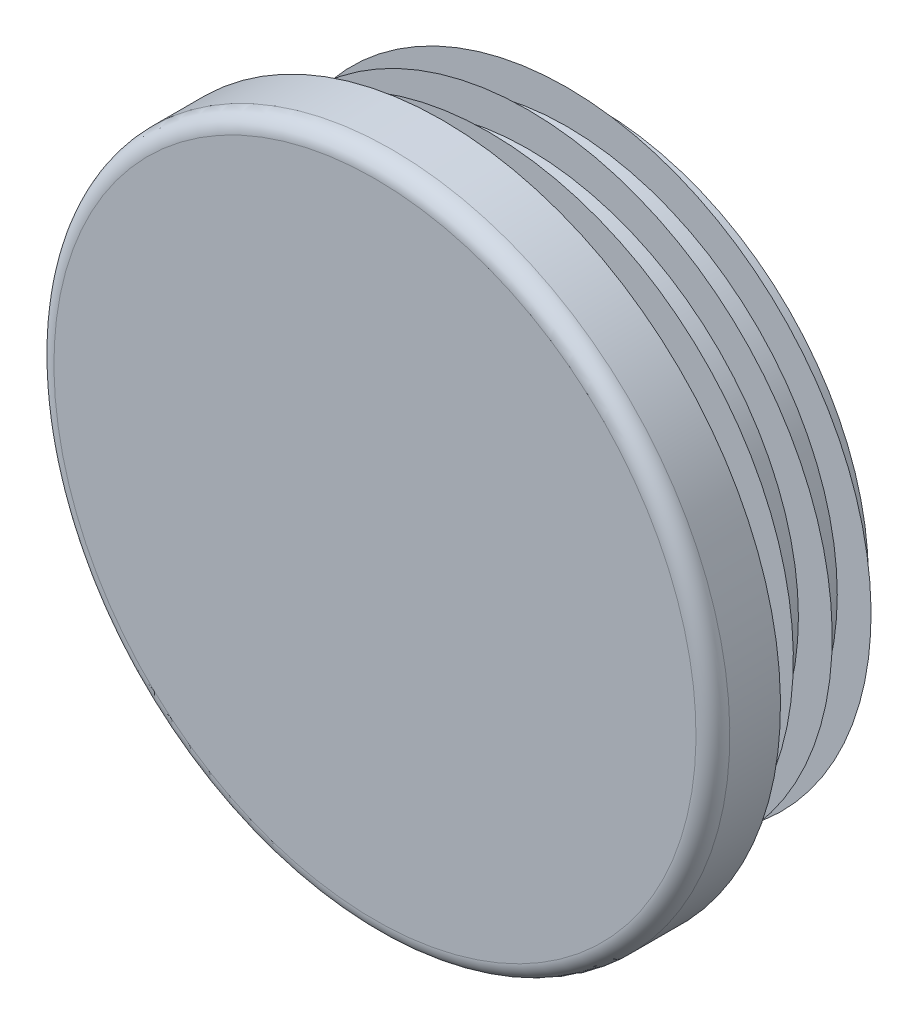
ISO-10303-21;
HEADER;
FILE_DESCRIPTION(('STEP AP214'),'2;1');
FILE_NAME('part.step','',(''),(''),'','','');
FILE_SCHEMA(('AUTOMOTIVE_DESIGN { 1 0 10303 214 1 1 1 1 }'));
ENDSEC;
DATA;
#1=APPLICATION_CONTEXT('core data for automotive mechanical design processes');
#2=APPLICATION_PROTOCOL_DEFINITION('international standard','automotive_design',2000,#1);
#3=PRODUCT_CONTEXT('',#1,'mechanical');
#4=PRODUCT('Part','Part','',(#3));
#5=PRODUCT_RELATED_PRODUCT_CATEGORY('part','',(#4));
#6=PRODUCT_DEFINITION_FORMATION('','',#4);
#7=PRODUCT_DEFINITION_CONTEXT('part definition',#1,'design');
#8=PRODUCT_DEFINITION('design','',#6,#7);
#9=PRODUCT_DEFINITION_SHAPE('','',#8);
#10=(LENGTH_UNIT() NAMED_UNIT(*) SI_UNIT(.MILLI.,.METRE.));
#11=(NAMED_UNIT(*) PLANE_ANGLE_UNIT() SI_UNIT($,.RADIAN.));
#12=(NAMED_UNIT(*) SI_UNIT($,.STERADIAN.) SOLID_ANGLE_UNIT());
#13=UNCERTAINTY_MEASURE_WITH_UNIT(LENGTH_MEASURE(1.E-05),#10,'distance_accuracy_value','');
#14=(GEOMETRIC_REPRESENTATION_CONTEXT(3) GLOBAL_UNCERTAINTY_ASSIGNED_CONTEXT((#13)) GLOBAL_UNIT_ASSIGNED_CONTEXT((#10,
#11,#12)) REPRESENTATION_CONTEXT('',''));
#15=CARTESIAN_POINT('',(0.,0.,0.));
#16=DIRECTION('',(0.,0.,1.));
#17=DIRECTION('',(1.,0.,0.));
#18=AXIS2_PLACEMENT_3D('',#15,#16,#17);
#19=CARTESIAN_POINT('',(0.,0.,5.));
#20=DIRECTION('',(0.,0.,-1.));
#21=DIRECTION('',(0.,1.,0.));
#22=AXIS2_PLACEMENT_3D('',#19,#20,#21);
#23=PLANE('',#22);
#24=CARTESIAN_POINT('',(0.,0.,5.));
#25=DIRECTION('',(0.,0.,-1.));
#26=DIRECTION('',(0.,1.,0.));
#27=AXIS2_PLACEMENT_3D('',#24,#25,#26);
#28=CIRCLE('',#27,23.75);
#29=CARTESIAN_POINT('',(0.,23.75,5.));
#30=VERTEX_POINT('',#29);
#31=EDGE_CURVE('E8',#30,#30,#28,.T.);
#32=ORIENTED_EDGE('',*,*,#31,.F.);
#33=EDGE_LOOP('',(#32));
#34=FACE_BOUND('',#33,.T.);
#35=ADVANCED_FACE('F12',(#34),#23,.F.);
#36=CARTESIAN_POINT('',(0.,0.,3.75));
#37=DIRECTION('',(0.,0.,-1.));
#38=DIRECTION('',(0.,1.,0.));
#39=AXIS2_PLACEMENT_3D('',#36,#37,#38);
#40=TOROIDAL_SURFACE('',#39,23.75,1.25);
#41=ORIENTED_EDGE('',*,*,#31,.T.);
#42=EDGE_LOOP('',(#41));
#43=FACE_BOUND('',#42,.T.);
#44=CARTESIAN_POINT('',(0.,0.,3.75));
#45=DIRECTION('',(0.,0.,-1.));
#46=DIRECTION('',(0.,1.,0.));
#47=AXIS2_PLACEMENT_3D('',#44,#45,#46);
#48=CIRCLE('',#47,25.);
#49=CARTESIAN_POINT('',(0.,25.,3.75));
#50=VERTEX_POINT('',#49);
#51=EDGE_CURVE('E18',#50,#50,#48,.T.);
#52=ORIENTED_EDGE('',*,*,#51,.F.);
#53=EDGE_LOOP('',(#52));
#54=FACE_BOUND('',#53,.T.);
#55=ADVANCED_FACE('F159',(#43,#54),#40,.T.);
#56=CARTESIAN_POINT('',(0.,0.,-11.5));
#57=DIRECTION('',(0.,0.,-1.));
#58=DIRECTION('',(0.,1.,0.));
#59=AXIS2_PLACEMENT_3D('',#56,#57,#58);
#60=CYLINDRICAL_SURFACE('',#59,25.);
#61=CARTESIAN_POINT('',(0.,0.,0.));
#62=DIRECTION('',(0.,0.,-1.));
#63=DIRECTION('',(0.,1.,0.));
#64=AXIS2_PLACEMENT_3D('',#61,#62,#63);
#65=CIRCLE('',#64,25.);
#66=CARTESIAN_POINT('',(0.,25.,0.));
#67=VERTEX_POINT('',#66);
#68=EDGE_CURVE('E22',#67,#67,#65,.T.);
#69=ORIENTED_EDGE('',*,*,#68,.F.);
#70=EDGE_LOOP('',(#69));
#71=FACE_BOUND('',#70,.T.);
#72=ORIENTED_EDGE('',*,*,#51,.T.);
#73=EDGE_LOOP('',(#72));
#74=FACE_BOUND('',#73,.T.);
#75=ADVANCED_FACE('F154',(#71,#74),#60,.T.);
#76=CARTESIAN_POINT('',(25.,0.,0.));
#77=DIRECTION('',(0.,0.,1.));
#78=DIRECTION('',(0.,-1.,0.));
#79=AXIS2_PLACEMENT_3D('',#76,#77,#78);
#80=PLANE('',#79);
#81=CARTESIAN_POINT('',(0.,0.,0.));
#82=DIRECTION('',(0.,0.,-1.));
#83=DIRECTION('',(0.,1.,0.));
#84=AXIS2_PLACEMENT_3D('',#81,#82,#83);
#85=CIRCLE('',#84,20.);
#86=CARTESIAN_POINT('',(0.,20.,0.));
#87=VERTEX_POINT('',#86);
#88=EDGE_CURVE('E26',#87,#87,#85,.T.);
#89=ORIENTED_EDGE('',*,*,#88,.F.);
#90=EDGE_LOOP('',(#89));
#91=FACE_BOUND('',#90,.T.);
#92=ORIENTED_EDGE('',*,*,#68,.T.);
#93=EDGE_LOOP('',(#92));
#94=FACE_BOUND('',#93,.T.);
#95=ADVANCED_FACE('F148',(#91,#94),#80,.F.);
#96=CARTESIAN_POINT('',(0.,0.,-11.5));
#97=DIRECTION('',(0.,0.,-1.));
#98=DIRECTION('',(0.,1.,0.));
#99=AXIS2_PLACEMENT_3D('',#96,#97,#98);
#100=CYLINDRICAL_SURFACE('',#99,20.);
#101=CARTESIAN_POINT('',(0.,0.,-0.575));
#102=DIRECTION('',(0.,0.,-1.));
#103=DIRECTION('',(0.,1.,0.));
#104=AXIS2_PLACEMENT_3D('',#101,#102,#103);
#105=CIRCLE('',#104,20.);
#106=CARTESIAN_POINT('',(0.,20.,-0.575));
#107=VERTEX_POINT('',#106);
#108=EDGE_CURVE('E31',#107,#107,#105,.T.);
#109=ORIENTED_EDGE('',*,*,#108,.F.);
#110=EDGE_LOOP('',(#109));
#111=FACE_BOUND('',#110,.T.);
#112=ORIENTED_EDGE('',*,*,#88,.T.);
#113=EDGE_LOOP('',(#112));
#114=FACE_BOUND('',#113,.T.);
#115=ADVANCED_FACE('F142',(#111,#114),#100,.T.);
#116=CARTESIAN_POINT('',(20.,0.,-0.575));
#117=DIRECTION('',(0.,0.,-1.));
#118=DIRECTION('',(0.,1.,0.));
#119=AXIS2_PLACEMENT_3D('',#116,#117,#118);
#120=PLANE('',#119);
#121=CARTESIAN_POINT('',(0.,0.,-0.575));
#122=DIRECTION('',(0.,0.,-1.));
#123=DIRECTION('',(0.,1.,0.));
#124=AXIS2_PLACEMENT_3D('',#121,#122,#123);
#125=CIRCLE('',#124,22.5);
#126=CARTESIAN_POINT('',(0.,22.5,-0.575));
#127=VERTEX_POINT('',#126);
#128=EDGE_CURVE('E34',#127,#127,#125,.T.);
#129=ORIENTED_EDGE('',*,*,#128,.F.);
#130=EDGE_LOOP('',(#129));
#131=FACE_BOUND('',#130,.T.);
#132=ORIENTED_EDGE('',*,*,#108,.T.);
#133=EDGE_LOOP('',(#132));
#134=FACE_BOUND('',#133,.T.);
#135=ADVANCED_FACE('F136',(#131,#134),#120,.F.);
#136=CARTESIAN_POINT('',(0.,0.,-0.575));
#137=DIRECTION('',(0.,0.,1.));
#138=DIRECTION('',(0.,-1.,0.));
#139=AXIS2_PLACEMENT_3D('',#136,#137,#138);
#140=CONICAL_SURFACE('',#139,22.5,0.959931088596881);
#141=CARTESIAN_POINT('',(0.,0.,-2.32551884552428));
#142=DIRECTION('',(0.,0.,-1.));
#143=DIRECTION('',(0.,1.,0.));
#144=AXIS2_PLACEMENT_3D('',#141,#142,#143);
#145=CIRCLE('',#144,20.);
#146=CARTESIAN_POINT('',(0.,20.,-2.32551884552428));
#147=VERTEX_POINT('',#146);
#148=EDGE_CURVE('E37',#147,#147,#145,.T.);
#149=ORIENTED_EDGE('',*,*,#148,.F.);
#150=EDGE_LOOP('',(#149));
#151=FACE_BOUND('',#150,.T.);
#152=ORIENTED_EDGE('',*,*,#128,.T.);
#153=EDGE_LOOP('',(#152));
#154=FACE_BOUND('',#153,.T.);
#155=ADVANCED_FACE('F130',(#151,#154),#140,.T.);
#156=CARTESIAN_POINT('',(0.,0.,-11.5));
#157=DIRECTION('',(0.,0.,-1.));
#158=DIRECTION('',(0.,1.,0.));
#159=AXIS2_PLACEMENT_3D('',#156,#157,#158);
#160=CYLINDRICAL_SURFACE('',#159,20.);
#161=CARTESIAN_POINT('',(0.,0.,-3.45));
#162=DIRECTION('',(0.,0.,-1.));
#163=DIRECTION('',(0.,1.,0.));
#164=AXIS2_PLACEMENT_3D('',#161,#162,#163);
#165=CIRCLE('',#164,20.);
#166=CARTESIAN_POINT('',(0.,20.,-3.45));
#167=VERTEX_POINT('',#166);
#168=EDGE_CURVE('E40',#167,#167,#165,.T.);
#169=ORIENTED_EDGE('',*,*,#168,.F.);
#170=EDGE_LOOP('',(#169));
#171=FACE_BOUND('',#170,.T.);
#172=ORIENTED_EDGE('',*,*,#148,.T.);
#173=EDGE_LOOP('',(#172));
#174=FACE_BOUND('',#173,.T.);
#175=ADVANCED_FACE('F124',(#171,#174),#160,.T.);
#176=CARTESIAN_POINT('',(20.,0.,-3.45));
#177=DIRECTION('',(0.,0.,-1.));
#178=DIRECTION('',(0.,1.,0.));
#179=AXIS2_PLACEMENT_3D('',#176,#177,#178);
#180=PLANE('',#179);
#181=CARTESIAN_POINT('',(0.,0.,-3.45));
#182=DIRECTION('',(0.,0.,-1.));
#183=DIRECTION('',(0.,1.,0.));
#184=AXIS2_PLACEMENT_3D('',#181,#182,#183);
#185=CIRCLE('',#184,22.5);
#186=CARTESIAN_POINT('',(0.,22.5,-3.45));
#187=VERTEX_POINT('',#186);
#188=EDGE_CURVE('E43',#187,#187,#185,.T.);
#189=ORIENTED_EDGE('',*,*,#188,.F.);
#190=EDGE_LOOP('',(#189));
#191=FACE_BOUND('',#190,.T.);
#192=ORIENTED_EDGE('',*,*,#168,.T.);
#193=EDGE_LOOP('',(#192));
#194=FACE_BOUND('',#193,.T.);
#195=ADVANCED_FACE('F118',(#191,#194),#180,.F.);
#196=CARTESIAN_POINT('',(0.,0.,-3.45));
#197=DIRECTION('',(0.,0.,1.));
#198=DIRECTION('',(0.,-1.,0.));
#199=AXIS2_PLACEMENT_3D('',#196,#197,#198);
#200=CONICAL_SURFACE('',#199,22.5,0.959931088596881);
#201=CARTESIAN_POINT('',(0.,0.,-5.20051884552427));
#202=DIRECTION('',(0.,0.,-1.));
#203=DIRECTION('',(0.,1.,0.));
#204=AXIS2_PLACEMENT_3D('',#201,#202,#203);
#205=CIRCLE('',#204,20.);
#206=CARTESIAN_POINT('',(0.,20.,-5.20051884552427));
#207=VERTEX_POINT('',#206);
#208=EDGE_CURVE('E46',#207,#207,#205,.T.);
#209=ORIENTED_EDGE('',*,*,#208,.F.);
#210=EDGE_LOOP('',(#209));
#211=FACE_BOUND('',#210,.T.);
#212=ORIENTED_EDGE('',*,*,#188,.T.);
#213=EDGE_LOOP('',(#212));
#214=FACE_BOUND('',#213,.T.);
#215=ADVANCED_FACE('F112',(#211,#214),#200,.T.);
#216=CARTESIAN_POINT('',(0.,0.,-11.5));
#217=DIRECTION('',(0.,0.,-1.));
#218=DIRECTION('',(0.,1.,0.));
#219=AXIS2_PLACEMENT_3D('',#216,#217,#218);
#220=CYLINDRICAL_SURFACE('',#219,20.);
#221=CARTESIAN_POINT('',(0.,0.,-6.325));
#222=DIRECTION('',(0.,0.,-1.));
#223=DIRECTION('',(0.,1.,0.));
#224=AXIS2_PLACEMENT_3D('',#221,#222,#223);
#225=CIRCLE('',#224,20.);
#226=CARTESIAN_POINT('',(0.,20.,-6.325));
#227=VERTEX_POINT('',#226);
#228=EDGE_CURVE('E49',#227,#227,#225,.T.);
#229=ORIENTED_EDGE('',*,*,#228,.F.);
#230=EDGE_LOOP('',(#229));
#231=FACE_BOUND('',#230,.T.);
#232=ORIENTED_EDGE('',*,*,#208,.T.);
#233=EDGE_LOOP('',(#232));
#234=FACE_BOUND('',#233,.T.);
#235=ADVANCED_FACE('F106',(#231,#234),#220,.T.);
#236=CARTESIAN_POINT('',(20.,0.,-6.325));
#237=DIRECTION('',(0.,0.,-1.));
#238=DIRECTION('',(0.,1.,0.));
#239=AXIS2_PLACEMENT_3D('',#236,#237,#238);
#240=PLANE('',#239);
#241=CARTESIAN_POINT('',(0.,0.,-6.325));
#242=DIRECTION('',(0.,0.,-1.));
#243=DIRECTION('',(0.,1.,0.));
#244=AXIS2_PLACEMENT_3D('',#241,#242,#243);
#245=CIRCLE('',#244,22.5);
#246=CARTESIAN_POINT('',(0.,22.5,-6.325));
#247=VERTEX_POINT('',#246);
#248=EDGE_CURVE('E52',#247,#247,#245,.T.);
#249=ORIENTED_EDGE('',*,*,#248,.F.);
#250=EDGE_LOOP('',(#249));
#251=FACE_BOUND('',#250,.T.);
#252=ORIENTED_EDGE('',*,*,#228,.T.);
#253=EDGE_LOOP('',(#252));
#254=FACE_BOUND('',#253,.T.);
#255=ADVANCED_FACE('F100',(#251,#254),#240,.F.);
#256=CARTESIAN_POINT('',(0.,0.,-6.325));
#257=DIRECTION('',(0.,0.,1.));
#258=DIRECTION('',(0.,-1.,0.));
#259=AXIS2_PLACEMENT_3D('',#256,#257,#258);
#260=CONICAL_SURFACE('',#259,22.5,0.95993108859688);
#261=CARTESIAN_POINT('',(0.,0.,-8.07551884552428));
#262=DIRECTION('',(0.,0.,-1.));
#263=DIRECTION('',(0.,1.,0.));
#264=AXIS2_PLACEMENT_3D('',#261,#262,#263);
#265=CIRCLE('',#264,20.);
#266=CARTESIAN_POINT('',(0.,20.,-8.07551884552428));
#267=VERTEX_POINT('',#266);
#268=EDGE_CURVE('E55',#267,#267,#265,.T.);
#269=ORIENTED_EDGE('',*,*,#268,.F.);
#270=EDGE_LOOP('',(#269));
#271=FACE_BOUND('',#270,.T.);
#272=ORIENTED_EDGE('',*,*,#248,.T.);
#273=EDGE_LOOP('',(#272));
#274=FACE_BOUND('',#273,.T.);
#275=ADVANCED_FACE('F94',(#271,#274),#260,.T.);
#276=CARTESIAN_POINT('',(0.,0.,-11.5));
#277=DIRECTION('',(0.,0.,-1.));
#278=DIRECTION('',(0.,1.,0.));
#279=AXIS2_PLACEMENT_3D('',#276,#277,#278);
#280=CYLINDRICAL_SURFACE('',#279,20.);
#281=CARTESIAN_POINT('',(0.,0.,-9.2));
#282=DIRECTION('',(0.,0.,-1.));
#283=DIRECTION('',(0.,1.,0.));
#284=AXIS2_PLACEMENT_3D('',#281,#282,#283);
#285=CIRCLE('',#284,20.);
#286=CARTESIAN_POINT('',(0.,20.,-9.2));
#287=VERTEX_POINT('',#286);
#288=EDGE_CURVE('E58',#287,#287,#285,.T.);
#289=ORIENTED_EDGE('',*,*,#288,.F.);
#290=EDGE_LOOP('',(#289));
#291=FACE_BOUND('',#290,.T.);
#292=ORIENTED_EDGE('',*,*,#268,.T.);
#293=EDGE_LOOP('',(#292));
#294=FACE_BOUND('',#293,.T.);
#295=ADVANCED_FACE('F88',(#291,#294),#280,.T.);
#296=CARTESIAN_POINT('',(20.,0.,-9.2));
#297=DIRECTION('',(0.,0.,-1.));
#298=DIRECTION('',(0.,1.,0.));
#299=AXIS2_PLACEMENT_3D('',#296,#297,#298);
#300=PLANE('',#299);
#301=CARTESIAN_POINT('',(0.,0.,-9.2));
#302=DIRECTION('',(0.,0.,-1.));
#303=DIRECTION('',(0.,1.,0.));
#304=AXIS2_PLACEMENT_3D('',#301,#302,#303);
#305=CIRCLE('',#304,22.5);
#306=CARTESIAN_POINT('',(0.,22.5,-9.2));
#307=VERTEX_POINT('',#306);
#308=EDGE_CURVE('E61',#307,#307,#305,.T.);
#309=ORIENTED_EDGE('',*,*,#308,.F.);
#310=EDGE_LOOP('',(#309));
#311=FACE_BOUND('',#310,.T.);
#312=ORIENTED_EDGE('',*,*,#288,.T.);
#313=EDGE_LOOP('',(#312));
#314=FACE_BOUND('',#313,.T.);
#315=ADVANCED_FACE('F82',(#311,#314),#300,.F.);
#316=CARTESIAN_POINT('',(0.,0.,-9.2));
#317=DIRECTION('',(0.,0.,1.));
#318=DIRECTION('',(0.,-1.,0.));
#319=AXIS2_PLACEMENT_3D('',#316,#317,#318);
#320=CONICAL_SURFACE('',#319,22.5,0.959931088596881);
#321=CARTESIAN_POINT('',(0.,0.,-10.9505188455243));
#322=DIRECTION('',(0.,0.,-1.));
#323=DIRECTION('',(0.,1.,0.));
#324=AXIS2_PLACEMENT_3D('',#321,#322,#323);
#325=CIRCLE('',#324,20.);
#326=CARTESIAN_POINT('',(0.,20.,-10.9505188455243));
#327=VERTEX_POINT('',#326);
#328=EDGE_CURVE('E64',#327,#327,#325,.T.);
#329=ORIENTED_EDGE('',*,*,#328,.F.);
#330=EDGE_LOOP('',(#329));
#331=FACE_BOUND('',#330,.T.);
#332=ORIENTED_EDGE('',*,*,#308,.T.);
#333=EDGE_LOOP('',(#332));
#334=FACE_BOUND('',#333,.T.);
#335=ADVANCED_FACE('F76',(#331,#334),#320,.T.);
#336=CARTESIAN_POINT('',(0.,0.,-11.5));
#337=DIRECTION('',(0.,0.,-1.));
#338=DIRECTION('',(0.,1.,0.));
#339=AXIS2_PLACEMENT_3D('',#336,#337,#338);
#340=CYLINDRICAL_SURFACE('',#339,20.);
#341=CARTESIAN_POINT('',(0.,0.,-11.5));
#342=DIRECTION('',(0.,0.,-1.));
#343=DIRECTION('',(0.,1.,0.));
#344=AXIS2_PLACEMENT_3D('',#341,#342,#343);
#345=CIRCLE('',#344,20.);
#346=CARTESIAN_POINT('',(0.,20.,-11.5));
#347=VERTEX_POINT('',#346);
#348=EDGE_CURVE('E67',#347,#347,#345,.T.);
#349=ORIENTED_EDGE('',*,*,#348,.F.);
#350=EDGE_LOOP('',(#349));
#351=FACE_BOUND('',#350,.T.);
#352=ORIENTED_EDGE('',*,*,#328,.T.);
#353=EDGE_LOOP('',(#352));
#354=FACE_BOUND('',#353,.T.);
#355=ADVANCED_FACE('F73',(#351,#354),#340,.T.);
#356=CARTESIAN_POINT('',(20.,0.,-11.5));
#357=DIRECTION('',(0.,0.,1.));
#358=DIRECTION('',(0.,-1.,0.));
#359=AXIS2_PLACEMENT_3D('',#356,#357,#358);
#360=PLANE('',#359);
#361=ORIENTED_EDGE('',*,*,#348,.T.);
#362=EDGE_LOOP('',(#361));
#363=FACE_BOUND('',#362,.T.);
#364=ADVANCED_FACE('F71',(#363),#360,.F.);
#365=CLOSED_SHELL('',(#35,#55,#75,#95,#115,#135,#155,#175,#195,#215,#235,#255,#275,#295,#315,
#335,#355,#364));
#366=MANIFOLD_SOLID_BREP('B1',#365);
#367=ADVANCED_BREP_SHAPE_REPRESENTATION('',(#18,#366),#14);
#368=SHAPE_DEFINITION_REPRESENTATION(#9,#367);
ENDSEC;
END-ISO-10303-21;
